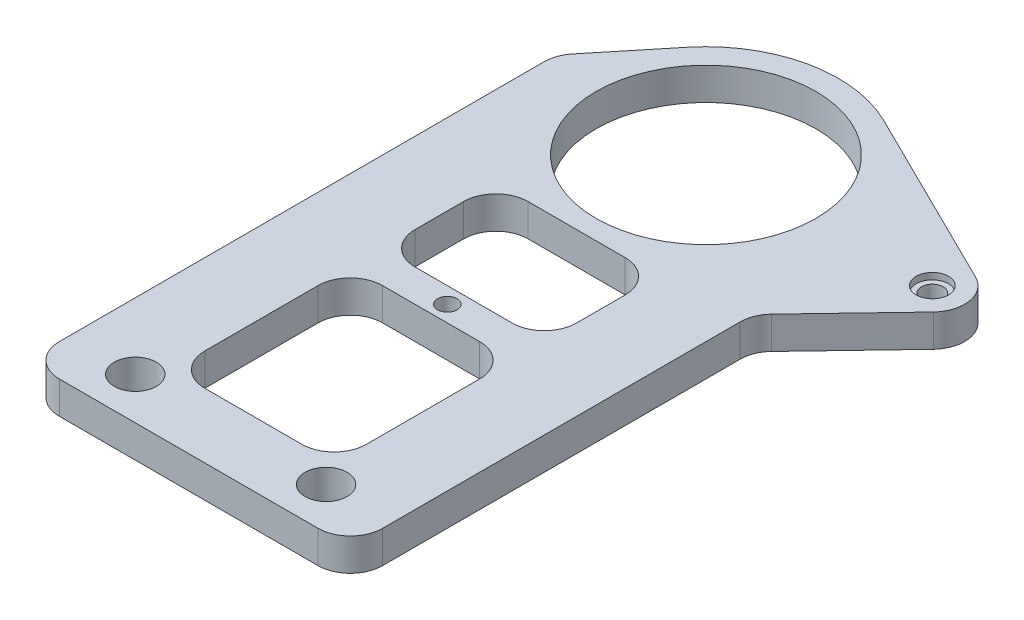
ISO-10303-21;
HEADER;
FILE_DESCRIPTION(('STEP AP214'),'2;1');
FILE_NAME('part.step','',(''),(''),'','','');
FILE_SCHEMA(('AUTOMOTIVE_DESIGN { 1 0 10303 214 1 1 1 1 }'));
ENDSEC;
DATA;
#1=APPLICATION_CONTEXT('core data for automotive mechanical design processes');
#2=APPLICATION_PROTOCOL_DEFINITION('international standard','automotive_design',2000,#1);
#3=PRODUCT_CONTEXT('',#1,'mechanical');
#4=PRODUCT('Part','Part','',(#3));
#5=PRODUCT_RELATED_PRODUCT_CATEGORY('part','',(#4));
#6=PRODUCT_DEFINITION_FORMATION('','',#4);
#7=PRODUCT_DEFINITION_CONTEXT('part definition',#1,'design');
#8=PRODUCT_DEFINITION('design','',#6,#7);
#9=PRODUCT_DEFINITION_SHAPE('','',#8);
#10=(LENGTH_UNIT() NAMED_UNIT(*) SI_UNIT(.MILLI.,.METRE.));
#11=(NAMED_UNIT(*) PLANE_ANGLE_UNIT() SI_UNIT($,.RADIAN.));
#12=(NAMED_UNIT(*) SI_UNIT($,.STERADIAN.) SOLID_ANGLE_UNIT());
#13=UNCERTAINTY_MEASURE_WITH_UNIT(LENGTH_MEASURE(1.E-05),#10,'distance_accuracy_value','');
#14=(GEOMETRIC_REPRESENTATION_CONTEXT(3) GLOBAL_UNCERTAINTY_ASSIGNED_CONTEXT((#13)) GLOBAL_UNIT_ASSIGNED_CONTEXT((#10,
#11,#12)) REPRESENTATION_CONTEXT('',''));
#15=CARTESIAN_POINT('',(0.,0.,0.));
#16=DIRECTION('',(0.,0.,1.));
#17=DIRECTION('',(1.,0.,0.));
#18=AXIS2_PLACEMENT_3D('',#15,#16,#17);
#19=CARTESIAN_POINT('',(70.,10.,0.));
#20=DIRECTION('',(0.,1.,0.));
#21=DIRECTION('',(0.,0.,1.));
#22=AXIS2_PLACEMENT_3D('',#19,#20,#21);
#23=PLANE('',#22);
#24=CARTESIAN_POINT('',(70.,10.,0.));
#25=DIRECTION('',(0.,1.,0.));
#26=DIRECTION('',(0.,0.,1.));
#27=AXIS2_PLACEMENT_3D('',#24,#25,#26);
#28=CIRCLE('',#27,5.);
#29=CARTESIAN_POINT('',(70.,10.,5.));
#30=VERTEX_POINT('',#29);
#31=EDGE_CURVE('E742',#30,#30,#28,.T.);
#32=ORIENTED_EDGE('',*,*,#31,.F.);
#33=EDGE_LOOP('',(#32));
#34=FACE_BOUND('',#33,.T.);
#35=CARTESIAN_POINT('',(29.4999999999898,10.,147.));
#36=DIRECTION('',(0.,1.,0.));
#37=DIRECTION('',(0.,0.,1.));
#38=AXIS2_PLACEMENT_3D('',#35,#36,#37);
#39=CIRCLE('',#38,6.50000000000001);
#40=CARTESIAN_POINT('',(29.4999999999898,10.,153.5));
#41=VERTEX_POINT('',#40);
#42=EDGE_CURVE('E758',#41,#41,#39,.T.);
#43=ORIENTED_EDGE('',*,*,#42,.F.);
#44=EDGE_LOOP('',(#43));
#45=FACE_BOUND('',#44,.T.);
#46=DIRECTION('',(0.,0.,1.));
#47=VECTOR('',#46,1.);
#48=CARTESIAN_POINT('',(25.,10.,50.));
#49=LINE('',#48,#47);
#50=CARTESIAN_POINT('',(25.,10.,50.));
#51=VERTEX_POINT('',#50);
#52=CARTESIAN_POINT('',(25.,10.,65.));
#53=VERTEX_POINT('',#52);
#54=EDGE_CURVE('E322',#51,#53,#49,.T.);
#55=ORIENTED_EDGE('',*,*,#54,.T.);
#56=CARTESIAN_POINT('',(15.,10.,65.));
#57=DIRECTION('',(0.,1.,0.));
#58=DIRECTION('',(0.,0.,1.));
#59=AXIS2_PLACEMENT_3D('',#56,#57,#58);
#60=CIRCLE('',#59,9.99999999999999);
#61=CARTESIAN_POINT('',(15.,10.,75.));
#62=VERTEX_POINT('',#61);
#63=EDGE_CURVE('E320',#62,#53,#60,.T.);
#64=ORIENTED_EDGE('',*,*,#63,.F.);
#65=DIRECTION('',(1.,0.,0.));
#66=VECTOR('',#65,1.);
#67=CARTESIAN_POINT('',(-15.,10.,75.));
#68=LINE('',#67,#66);
#69=CARTESIAN_POINT('',(-15.,10.,75.));
#70=VERTEX_POINT('',#69);
#71=EDGE_CURVE('E338',#70,#62,#68,.T.);
#72=ORIENTED_EDGE('',*,*,#71,.F.);
#73=CARTESIAN_POINT('',(-15.,10.,65.));
#74=DIRECTION('',(0.,-1.,0.));
#75=DIRECTION('',(0.,0.,-1.));
#76=AXIS2_PLACEMENT_3D('',#73,#74,#75);
#77=CIRCLE('',#76,9.99999999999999);
#78=CARTESIAN_POINT('',(-25.,10.,65.));
#79=VERTEX_POINT('',#78);
#80=EDGE_CURVE('E335',#70,#79,#77,.T.);
#81=ORIENTED_EDGE('',*,*,#80,.T.);
#82=DIRECTION('',(0.,0.,-1.));
#83=VECTOR('',#82,1.);
#84=CARTESIAN_POINT('',(-25.,10.,65.));
#85=LINE('',#84,#83);
#86=CARTESIAN_POINT('',(-25.,10.,50.));
#87=VERTEX_POINT('',#86);
#88=EDGE_CURVE('E332',#79,#87,#85,.T.);
#89=ORIENTED_EDGE('',*,*,#88,.T.);
#90=CARTESIAN_POINT('',(-15.,10.,50.));
#91=DIRECTION('',(0.,-1.,0.));
#92=DIRECTION('',(0.,0.,-1.));
#93=AXIS2_PLACEMENT_3D('',#90,#91,#92);
#94=CIRCLE('',#93,10.);
#95=CARTESIAN_POINT('',(-15.,10.,40.));
#96=VERTEX_POINT('',#95);
#97=EDGE_CURVE('E329',#87,#96,#94,.T.);
#98=ORIENTED_EDGE('',*,*,#97,.T.);
#99=DIRECTION('',(-1.,0.,0.));
#100=VECTOR('',#99,1.);
#101=CARTESIAN_POINT('',(15.,10.,40.));
#102=LINE('',#101,#100);
#103=CARTESIAN_POINT('',(15.,10.,40.));
#104=VERTEX_POINT('',#103);
#105=EDGE_CURVE('E327',#104,#96,#102,.T.);
#106=ORIENTED_EDGE('',*,*,#105,.F.);
#107=CARTESIAN_POINT('',(15.,10.,50.));
#108=DIRECTION('',(0.,1.,0.));
#109=DIRECTION('',(0.,0.,1.));
#110=AXIS2_PLACEMENT_3D('',#107,#108,#109);
#111=CIRCLE('',#110,10.);
#112=EDGE_CURVE('E325',#51,#104,#111,.T.);
#113=ORIENTED_EDGE('',*,*,#112,.F.);
#114=EDGE_LOOP('',(#55,#64,#72,#81,#89,#98,#106,#113));
#115=FACE_BOUND('',#114,.T.);
#116=CARTESIAN_POINT('',(70.,10.,0.));
#117=DIRECTION('',(0.,1.,0.));
#118=DIRECTION('',(0.,0.,1.));
#119=AXIS2_PLACEMENT_3D('',#116,#117,#118);
#120=CIRCLE('',#119,10.);
#121=CARTESIAN_POINT('',(77.2317249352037,10.,6.90667463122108));
#122=VERTEX_POINT('',#121);
#123=CARTESIAN_POINT('',(74.4285714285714,10.,-8.9659218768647));
#124=VERTEX_POINT('',#123);
#125=EDGE_CURVE('E388',#122,#124,#120,.T.);
#126=ORIENTED_EDGE('',*,*,#125,.T.);
#127=DIRECTION('',(-0.896592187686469,0.,-0.442857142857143));
#128=VECTOR('',#127,1.);
#129=CARTESIAN_POINT('',(74.4285714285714,10.,-8.9659218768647));
#130=LINE('',#129,#128);
#131=CARTESIAN_POINT('',(18.1571428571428,10.,-36.7602796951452));
#132=VERTEX_POINT('',#131);
#133=EDGE_CURVE('E391',#124,#132,#130,.T.);
#134=ORIENTED_EDGE('',*,*,#133,.T.);
#135=CARTESIAN_POINT('',(0.,10.,0.));
#136=DIRECTION('',(0.,1.,0.));
#137=DIRECTION('',(0.,0.,1.));
#138=AXIS2_PLACEMENT_3D('',#135,#136,#137);
#139=CIRCLE('',#138,41.);
#140=CARTESIAN_POINT('',(-31.775,10.,-25.9104105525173));
#141=VERTEX_POINT('',#140);
#142=EDGE_CURVE('E393',#132,#141,#139,.T.);
#143=ORIENTED_EDGE('',*,*,#142,.T.);
#144=DIRECTION('',(0.631961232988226,0.,-0.775));
#145=VECTOR('',#144,1.);
#146=CARTESIAN_POINT('',(-47.75,10.,-6.31961232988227));
#147=LINE('',#146,#145);
#148=CARTESIAN_POINT('',(-47.75,10.,-6.31961232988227));
#149=VERTEX_POINT('',#148);
#150=EDGE_CURVE('E395',#149,#141,#147,.T.);
#151=ORIENTED_EDGE('',*,*,#150,.F.);
#152=CARTESIAN_POINT('',(-40.,10.,0.));
#153=DIRECTION('',(0.,1.,0.));
#154=DIRECTION('',(0.,0.,1.));
#155=AXIS2_PLACEMENT_3D('',#152,#153,#154);
#156=CIRCLE('',#155,10.);
#157=CARTESIAN_POINT('',(-50.,10.,0.));
#158=VERTEX_POINT('',#157);
#159=EDGE_CURVE('E398',#149,#158,#156,.T.);
#160=ORIENTED_EDGE('',*,*,#159,.T.);
#161=DIRECTION('',(0.,0.,-1.));
#162=VECTOR('',#161,1.);
#163=CARTESIAN_POINT('',(-50.,10.,150.));
#164=LINE('',#163,#162);
#165=CARTESIAN_POINT('',(-50.,10.,150.));
#166=VERTEX_POINT('',#165);
#167=EDGE_CURVE('E400',#166,#158,#164,.T.);
#168=ORIENTED_EDGE('',*,*,#167,.F.);
#169=CARTESIAN_POINT('',(-40.,10.,150.));
#170=DIRECTION('',(0.,-1.,0.));
#171=DIRECTION('',(0.,0.,-1.));
#172=AXIS2_PLACEMENT_3D('',#169,#170,#171);
#173=CIRCLE('',#172,10.);
#174=CARTESIAN_POINT('',(-40.,10.,160.));
#175=VERTEX_POINT('',#174);
#176=EDGE_CURVE('E403',#175,#166,#173,.T.);
#177=ORIENTED_EDGE('',*,*,#176,.F.);
#178=DIRECTION('',(-1.,0.,0.));
#179=VECTOR('',#178,1.);
#180=CARTESIAN_POINT('',(40.,10.,160.));
#181=LINE('',#180,#179);
#182=CARTESIAN_POINT('',(40.,10.,160.));
#183=VERTEX_POINT('',#182);
#184=EDGE_CURVE('E406',#183,#175,#181,.T.);
#185=ORIENTED_EDGE('',*,*,#184,.F.);
#186=CARTESIAN_POINT('',(40.,10.,150.));
#187=DIRECTION('',(0.,1.,0.));
#188=DIRECTION('',(0.,0.,1.));
#189=AXIS2_PLACEMENT_3D('',#186,#187,#188);
#190=CIRCLE('',#189,10.);
#191=CARTESIAN_POINT('',(50.,10.,150.));
#192=VERTEX_POINT('',#191);
#193=EDGE_CURVE('E409',#183,#192,#190,.T.);
#194=ORIENTED_EDGE('',*,*,#193,.T.);
#195=DIRECTION('',(0.,0.,-1.));
#196=VECTOR('',#195,1.);
#197=CARTESIAN_POINT('',(50.,10.,150.));
#198=LINE('',#197,#196);
#199=CARTESIAN_POINT('',(50.,10.,39.4281277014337));
#200=VERTEX_POINT('',#199);
#201=EDGE_CURVE('E411',#192,#200,#198,.T.);
#202=ORIENTED_EDGE('',*,*,#201,.T.);
#203=CARTESIAN_POINT('',(60.,10.,39.4281277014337));
#204=DIRECTION('',(0.,-1.,0.));
#205=DIRECTION('',(0.,0.,-1.));
#206=AXIS2_PLACEMENT_3D('',#203,#204,#205);
#207=CIRCLE('',#206,10.);
#208=CARTESIAN_POINT('',(52.7682750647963,10.,32.5214530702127));
#209=VERTEX_POINT('',#208);
#210=EDGE_CURVE('E413',#200,#209,#207,.T.);
#211=ORIENTED_EDGE('',*,*,#210,.T.);
#212=DIRECTION('',(0.690667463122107,0.,-0.723172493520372));
#213=VECTOR('',#212,1.);
#214=CARTESIAN_POINT('',(52.7682750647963,10.,32.5214530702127));
#215=LINE('',#214,#213);
#216=EDGE_CURVE('E415',#209,#122,#215,.T.);
#217=ORIENTED_EDGE('',*,*,#216,.T.);
#218=EDGE_LOOP('',(#126,#134,#143,#151,#160,#168,#177,#185,#194,#202,#211,#217));
#219=FACE_BOUND('',#218,.T.);
#220=CARTESIAN_POINT('',(0.,10.,0.));
#221=DIRECTION('',(0.,1.,0.));
#222=DIRECTION('',(0.,0.,1.));
#223=AXIS2_PLACEMENT_3D('',#220,#221,#222);
#224=CIRCLE('',#223,34.);
#225=CARTESIAN_POINT('',(0.,10.,34.));
#226=VERTEX_POINT('',#225);
#227=EDGE_CURVE('E293',#226,#226,#224,.T.);
#228=ORIENTED_EDGE('',*,*,#227,.F.);
#229=EDGE_LOOP('',(#228));
#230=FACE_BOUND('',#229,.T.);
#231=DIRECTION('',(0.,0.,1.));
#232=VECTOR('',#231,1.);
#233=CARTESIAN_POINT('',(-25.,10.,95.));
#234=LINE('',#233,#232);
#235=CARTESIAN_POINT('',(-25.,10.,95.));
#236=VERTEX_POINT('',#235);
#237=CARTESIAN_POINT('',(-24.9999999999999,10.,130.));
#238=VERTEX_POINT('',#237);
#239=EDGE_CURVE('E263',#236,#238,#234,.T.);
#240=ORIENTED_EDGE('',*,*,#239,.F.);
#241=CARTESIAN_POINT('',(-15.,10.,95.));
#242=DIRECTION('',(0.,1.,0.));
#243=DIRECTION('',(0.,0.,1.));
#244=AXIS2_PLACEMENT_3D('',#241,#242,#243);
#245=CIRCLE('',#244,9.99999999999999);
#246=CARTESIAN_POINT('',(-15.,10.,85.));
#247=VERTEX_POINT('',#246);
#248=EDGE_CURVE('E232',#247,#236,#245,.T.);
#249=ORIENTED_EDGE('',*,*,#248,.F.);
#250=DIRECTION('',(1.,0.,0.));
#251=VECTOR('',#250,1.);
#252=CARTESIAN_POINT('',(-15.,10.,85.));
#253=LINE('',#252,#251);
#254=CARTESIAN_POINT('',(15.,10.,85.));
#255=VERTEX_POINT('',#254);
#256=EDGE_CURVE('E275',#247,#255,#253,.T.);
#257=ORIENTED_EDGE('',*,*,#256,.T.);
#258=CARTESIAN_POINT('',(15.,10.,95.));
#259=DIRECTION('',(0.,-1.,0.));
#260=DIRECTION('',(0.,0.,-1.));
#261=AXIS2_PLACEMENT_3D('',#258,#259,#260);
#262=CIRCLE('',#261,9.99999999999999);
#263=CARTESIAN_POINT('',(25.,10.,95.));
#264=VERTEX_POINT('',#263);
#265=EDGE_CURVE('E47',#255,#264,#262,.T.);
#266=ORIENTED_EDGE('',*,*,#265,.T.);
#267=DIRECTION('',(0.,0.,-1.));
#268=VECTOR('',#267,1.);
#269=CARTESIAN_POINT('',(24.9999999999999,10.,130.));
#270=LINE('',#269,#268);
#271=CARTESIAN_POINT('',(24.9999999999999,10.,130.));
#272=VERTEX_POINT('',#271);
#273=EDGE_CURVE('E272',#272,#264,#270,.T.);
#274=ORIENTED_EDGE('',*,*,#273,.F.);
#275=CARTESIAN_POINT('',(14.9999999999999,10.,130.));
#276=DIRECTION('',(0.,1.,0.));
#277=DIRECTION('',(0.,0.,1.));
#278=AXIS2_PLACEMENT_3D('',#275,#276,#277);
#279=CIRCLE('',#278,10.);
#280=CARTESIAN_POINT('',(14.9999999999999,10.,140.));
#281=VERTEX_POINT('',#280);
#282=EDGE_CURVE('E270',#281,#272,#279,.T.);
#283=ORIENTED_EDGE('',*,*,#282,.F.);
#284=DIRECTION('',(1.,0.,0.));
#285=VECTOR('',#284,1.);
#286=CARTESIAN_POINT('',(-14.9999999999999,10.,140.));
#287=LINE('',#286,#285);
#288=CARTESIAN_POINT('',(-14.9999999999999,10.,140.));
#289=VERTEX_POINT('',#288);
#290=EDGE_CURVE('E268',#289,#281,#287,.T.);
#291=ORIENTED_EDGE('',*,*,#290,.F.);
#292=CARTESIAN_POINT('',(-14.9999999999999,10.,130.));
#293=DIRECTION('',(0.,-1.,0.));
#294=DIRECTION('',(0.,0.,-1.));
#295=AXIS2_PLACEMENT_3D('',#292,#293,#294);
#296=CIRCLE('',#295,10.);
#297=EDGE_CURVE('E265',#289,#238,#296,.T.);
#298=ORIENTED_EDGE('',*,*,#297,.T.);
#299=EDGE_LOOP('',(#240,#249,#257,#266,#274,#283,#291,#298));
#300=FACE_BOUND('',#299,.T.);
#301=CARTESIAN_POINT('',(0.,10.,80.));
#302=DIRECTION('',(0.,1.,0.));
#303=DIRECTION('',(0.,0.,1.));
#304=AXIS2_PLACEMENT_3D('',#301,#302,#303);
#305=CIRCLE('',#304,3.);
#306=CARTESIAN_POINT('',(0.,10.,83.));
#307=VERTEX_POINT('',#306);
#308=EDGE_CURVE('E241',#307,#307,#305,.T.);
#309=ORIENTED_EDGE('',*,*,#308,.F.);
#310=EDGE_LOOP('',(#309));
#311=FACE_BOUND('',#310,.T.);
#312=CARTESIAN_POINT('',(-29.4999999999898,10.,147.));
#313=DIRECTION('',(0.,1.,0.));
#314=DIRECTION('',(0.,0.,1.));
#315=AXIS2_PLACEMENT_3D('',#312,#313,#314);
#316=CIRCLE('',#315,6.5);
#317=CARTESIAN_POINT('',(-29.4999999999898,10.,153.5));
#318=VERTEX_POINT('',#317);
#319=EDGE_CURVE('E752',#318,#318,#316,.T.);
#320=ORIENTED_EDGE('',*,*,#319,.F.);
#321=EDGE_LOOP('',(#320));
#322=FACE_BOUND('',#321,.T.);
#323=ADVANCED_FACE('F31',(#34,#45,#115,#219,#230,#300,#311,#322),#23,.T.);
#324=CARTESIAN_POINT('',(70.,0.,0.));
#325=DIRECTION('',(0.,1.,0.));
#326=DIRECTION('',(0.,0.,1.));
#327=AXIS2_PLACEMENT_3D('',#324,#325,#326);
#328=PLANE('',#327);
#329=CARTESIAN_POINT('',(70.,0.,0.));
#330=DIRECTION('',(0.,1.,0.));
#331=DIRECTION('',(0.,0.,1.));
#332=AXIS2_PLACEMENT_3D('',#329,#330,#331);
#333=CIRCLE('',#332,3.375);
#334=CARTESIAN_POINT('',(70.,0.,3.375));
#335=VERTEX_POINT('',#334);
#336=EDGE_CURVE('E740',#335,#335,#333,.T.);
#337=ORIENTED_EDGE('',*,*,#336,.T.);
#338=EDGE_LOOP('',(#337));
#339=FACE_BOUND('',#338,.T.);
#340=CARTESIAN_POINT('',(29.4999999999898,0.,147.));
#341=DIRECTION('',(0.,1.,0.));
#342=DIRECTION('',(0.,0.,1.));
#343=AXIS2_PLACEMENT_3D('',#340,#341,#342);
#344=CIRCLE('',#343,6.50000000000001);
#345=CARTESIAN_POINT('',(29.4999999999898,0.,153.5));
#346=VERTEX_POINT('',#345);
#347=EDGE_CURVE('E755',#346,#346,#344,.T.);
#348=ORIENTED_EDGE('',*,*,#347,.T.);
#349=EDGE_LOOP('',(#348));
#350=FACE_BOUND('',#349,.T.);
#351=CARTESIAN_POINT('',(15.,0.,65.));
#352=DIRECTION('',(0.,1.,0.));
#353=DIRECTION('',(0.,0.,1.));
#354=AXIS2_PLACEMENT_3D('',#351,#352,#353);
#355=CIRCLE('',#354,9.99999999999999);
#356=CARTESIAN_POINT('',(15.,0.,75.));
#357=VERTEX_POINT('',#356);
#358=CARTESIAN_POINT('',(25.,0.,65.));
#359=VERTEX_POINT('',#358);
#360=EDGE_CURVE('E296',#357,#359,#355,.T.);
#361=ORIENTED_EDGE('',*,*,#360,.T.);
#362=DIRECTION('',(0.,0.,1.));
#363=VECTOR('',#362,1.);
#364=CARTESIAN_POINT('',(25.,0.,50.));
#365=LINE('',#364,#363);
#366=CARTESIAN_POINT('',(25.,0.,50.));
#367=VERTEX_POINT('',#366);
#368=EDGE_CURVE('E299',#367,#359,#365,.T.);
#369=ORIENTED_EDGE('',*,*,#368,.F.);
#370=CARTESIAN_POINT('',(15.,0.,50.));
#371=DIRECTION('',(0.,1.,0.));
#372=DIRECTION('',(0.,0.,1.));
#373=AXIS2_PLACEMENT_3D('',#370,#371,#372);
#374=CIRCLE('',#373,10.);
#375=CARTESIAN_POINT('',(15.,0.,40.));
#376=VERTEX_POINT('',#375);
#377=EDGE_CURVE('E302',#367,#376,#374,.T.);
#378=ORIENTED_EDGE('',*,*,#377,.T.);
#379=DIRECTION('',(-1.,0.,0.));
#380=VECTOR('',#379,1.);
#381=CARTESIAN_POINT('',(15.,0.,40.));
#382=LINE('',#381,#380);
#383=CARTESIAN_POINT('',(-15.,0.,40.));
#384=VERTEX_POINT('',#383);
#385=EDGE_CURVE('E305',#376,#384,#382,.T.);
#386=ORIENTED_EDGE('',*,*,#385,.T.);
#387=CARTESIAN_POINT('',(-15.,0.,50.));
#388=DIRECTION('',(0.,-1.,0.));
#389=DIRECTION('',(0.,0.,-1.));
#390=AXIS2_PLACEMENT_3D('',#387,#388,#389);
#391=CIRCLE('',#390,10.);
#392=CARTESIAN_POINT('',(-25.,0.,50.));
#393=VERTEX_POINT('',#392);
#394=EDGE_CURVE('E308',#393,#384,#391,.T.);
#395=ORIENTED_EDGE('',*,*,#394,.F.);
#396=DIRECTION('',(0.,0.,-1.));
#397=VECTOR('',#396,1.);
#398=CARTESIAN_POINT('',(-25.,0.,65.));
#399=LINE('',#398,#397);
#400=CARTESIAN_POINT('',(-25.,0.,65.));
#401=VERTEX_POINT('',#400);
#402=EDGE_CURVE('E311',#401,#393,#399,.T.);
#403=ORIENTED_EDGE('',*,*,#402,.F.);
#404=CARTESIAN_POINT('',(-15.,0.,65.));
#405=DIRECTION('',(0.,-1.,0.));
#406=DIRECTION('',(0.,0.,-1.));
#407=AXIS2_PLACEMENT_3D('',#404,#405,#406);
#408=CIRCLE('',#407,9.99999999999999);
#409=CARTESIAN_POINT('',(-15.,0.,75.));
#410=VERTEX_POINT('',#409);
#411=EDGE_CURVE('E314',#410,#401,#408,.T.);
#412=ORIENTED_EDGE('',*,*,#411,.F.);
#413=DIRECTION('',(1.,0.,0.));
#414=VECTOR('',#413,1.);
#415=CARTESIAN_POINT('',(-15.,0.,75.));
#416=LINE('',#415,#414);
#417=EDGE_CURVE('E317',#410,#357,#416,.T.);
#418=ORIENTED_EDGE('',*,*,#417,.T.);
#419=EDGE_LOOP('',(#361,#369,#378,#386,#395,#403,#412,#418));
#420=FACE_BOUND('',#419,.T.);
#421=CARTESIAN_POINT('',(70.,0.,0.));
#422=DIRECTION('',(0.,1.,0.));
#423=DIRECTION('',(0.,0.,1.));
#424=AXIS2_PLACEMENT_3D('',#421,#422,#423);
#425=CIRCLE('',#424,10.);
#426=CARTESIAN_POINT('',(77.2317249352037,0.,6.90667463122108));
#427=VERTEX_POINT('',#426);
#428=CARTESIAN_POINT('',(74.4285714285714,0.,-8.9659218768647));
#429=VERTEX_POINT('',#428);
#430=EDGE_CURVE('E357',#427,#429,#425,.T.);
#431=ORIENTED_EDGE('',*,*,#430,.F.);
#432=DIRECTION('',(0.690667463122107,0.,-0.723172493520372));
#433=VECTOR('',#432,1.);
#434=CARTESIAN_POINT('',(52.7682750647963,0.,32.5214530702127));
#435=LINE('',#434,#433);
#436=CARTESIAN_POINT('',(52.7682750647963,0.,32.5214530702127));
#437=VERTEX_POINT('',#436);
#438=EDGE_CURVE('E386',#437,#427,#435,.T.);
#439=ORIENTED_EDGE('',*,*,#438,.F.);
#440=CARTESIAN_POINT('',(60.,0.,39.4281277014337));
#441=DIRECTION('',(0.,-1.,0.));
#442=DIRECTION('',(0.,0.,-1.));
#443=AXIS2_PLACEMENT_3D('',#440,#441,#442);
#444=CIRCLE('',#443,10.);
#445=CARTESIAN_POINT('',(50.,0.,39.4281277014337));
#446=VERTEX_POINT('',#445);
#447=EDGE_CURVE('E384',#446,#437,#444,.T.);
#448=ORIENTED_EDGE('',*,*,#447,.F.);
#449=DIRECTION('',(0.,0.,-1.));
#450=VECTOR('',#449,1.);
#451=CARTESIAN_POINT('',(50.,0.,150.));
#452=LINE('',#451,#450);
#453=CARTESIAN_POINT('',(50.,0.,150.));
#454=VERTEX_POINT('',#453);
#455=EDGE_CURVE('E382',#454,#446,#452,.T.);
#456=ORIENTED_EDGE('',*,*,#455,.F.);
#457=CARTESIAN_POINT('',(40.,0.,150.));
#458=DIRECTION('',(0.,1.,0.));
#459=DIRECTION('',(0.,0.,1.));
#460=AXIS2_PLACEMENT_3D('',#457,#458,#459);
#461=CIRCLE('',#460,10.);
#462=CARTESIAN_POINT('',(40.,0.,160.));
#463=VERTEX_POINT('',#462);
#464=EDGE_CURVE('E380',#463,#454,#461,.T.);
#465=ORIENTED_EDGE('',*,*,#464,.F.);
#466=DIRECTION('',(-1.,0.,0.));
#467=VECTOR('',#466,1.);
#468=CARTESIAN_POINT('',(40.,0.,160.));
#469=LINE('',#468,#467);
#470=CARTESIAN_POINT('',(-40.,0.,160.));
#471=VERTEX_POINT('',#470);
#472=EDGE_CURVE('E377',#463,#471,#469,.T.);
#473=ORIENTED_EDGE('',*,*,#472,.T.);
#474=CARTESIAN_POINT('',(-40.,0.,150.));
#475=DIRECTION('',(0.,-1.,0.));
#476=DIRECTION('',(0.,0.,-1.));
#477=AXIS2_PLACEMENT_3D('',#474,#475,#476);
#478=CIRCLE('',#477,10.);
#479=CARTESIAN_POINT('',(-50.,0.,150.));
#480=VERTEX_POINT('',#479);
#481=EDGE_CURVE('E374',#471,#480,#478,.T.);
#482=ORIENTED_EDGE('',*,*,#481,.T.);
#483=DIRECTION('',(0.,0.,-1.));
#484=VECTOR('',#483,1.);
#485=CARTESIAN_POINT('',(-50.,0.,150.));
#486=LINE('',#485,#484);
#487=CARTESIAN_POINT('',(-50.,0.,0.));
#488=VERTEX_POINT('',#487);
#489=EDGE_CURVE('E371',#480,#488,#486,.T.);
#490=ORIENTED_EDGE('',*,*,#489,.T.);
#491=CARTESIAN_POINT('',(-40.,0.,0.));
#492=DIRECTION('',(0.,1.,0.));
#493=DIRECTION('',(0.,0.,1.));
#494=AXIS2_PLACEMENT_3D('',#491,#492,#493);
#495=CIRCLE('',#494,10.);
#496=CARTESIAN_POINT('',(-47.75,0.,-6.31961232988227));
#497=VERTEX_POINT('',#496);
#498=EDGE_CURVE('E368',#497,#488,#495,.T.);
#499=ORIENTED_EDGE('',*,*,#498,.F.);
#500=DIRECTION('',(0.631961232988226,0.,-0.775));
#501=VECTOR('',#500,1.);
#502=CARTESIAN_POINT('',(-47.75,0.,-6.31961232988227));
#503=LINE('',#502,#501);
#504=CARTESIAN_POINT('',(-31.775,0.,-25.9104105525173));
#505=VERTEX_POINT('',#504);
#506=EDGE_CURVE('E365',#497,#505,#503,.T.);
#507=ORIENTED_EDGE('',*,*,#506,.T.);
#508=CARTESIAN_POINT('',(0.,0.,0.));
#509=DIRECTION('',(0.,1.,0.));
#510=DIRECTION('',(0.,0.,1.));
#511=AXIS2_PLACEMENT_3D('',#508,#509,#510);
#512=CIRCLE('',#511,41.);
#513=CARTESIAN_POINT('',(18.1571428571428,0.,-36.7602796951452));
#514=VERTEX_POINT('',#513);
#515=EDGE_CURVE('E362',#514,#505,#512,.T.);
#516=ORIENTED_EDGE('',*,*,#515,.F.);
#517=DIRECTION('',(-0.896592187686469,0.,-0.442857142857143));
#518=VECTOR('',#517,1.);
#519=CARTESIAN_POINT('',(74.4285714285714,0.,-8.9659218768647));
#520=LINE('',#519,#518);
#521=EDGE_CURVE('E360',#429,#514,#520,.T.);
#522=ORIENTED_EDGE('',*,*,#521,.F.);
#523=EDGE_LOOP('',(#431,#439,#448,#456,#465,#473,#482,#490,#499,#507,#516,#522));
#524=FACE_BOUND('',#523,.T.);
#525=CARTESIAN_POINT('',(0.,0.,0.));
#526=DIRECTION('',(0.,1.,0.));
#527=DIRECTION('',(0.,0.,1.));
#528=AXIS2_PLACEMENT_3D('',#525,#526,#527);
#529=CIRCLE('',#528,34.);
#530=CARTESIAN_POINT('',(0.,0.,34.));
#531=VERTEX_POINT('',#530);
#532=EDGE_CURVE('E233',#531,#531,#529,.T.);
#533=ORIENTED_EDGE('',*,*,#532,.T.);
#534=EDGE_LOOP('',(#533));
#535=FACE_BOUND('',#534,.T.);
#536=CARTESIAN_POINT('',(-15.,0.,95.));
#537=DIRECTION('',(0.,1.,0.));
#538=DIRECTION('',(0.,0.,1.));
#539=AXIS2_PLACEMENT_3D('',#536,#537,#538);
#540=CIRCLE('',#539,9.99999999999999);
#541=CARTESIAN_POINT('',(-15.,0.,85.));
#542=VERTEX_POINT('',#541);
#543=CARTESIAN_POINT('',(-25.,0.,95.));
#544=VERTEX_POINT('',#543);
#545=EDGE_CURVE('E55',#542,#544,#540,.T.);
#546=ORIENTED_EDGE('',*,*,#545,.T.);
#547=DIRECTION('',(0.,0.,1.));
#548=VECTOR('',#547,1.);
#549=CARTESIAN_POINT('',(-25.,0.,95.));
#550=LINE('',#549,#548);
#551=CARTESIAN_POINT('',(-24.9999999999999,0.,130.));
#552=VERTEX_POINT('',#551);
#553=EDGE_CURVE('E219',#544,#552,#550,.T.);
#554=ORIENTED_EDGE('',*,*,#553,.T.);
#555=CARTESIAN_POINT('',(-14.9999999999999,0.,130.));
#556=DIRECTION('',(0.,-1.,0.));
#557=DIRECTION('',(0.,0.,-1.));
#558=AXIS2_PLACEMENT_3D('',#555,#556,#557);
#559=CIRCLE('',#558,10.);
#560=CARTESIAN_POINT('',(-14.9999999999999,0.,140.));
#561=VERTEX_POINT('',#560);
#562=EDGE_CURVE('E228',#561,#552,#559,.T.);
#563=ORIENTED_EDGE('',*,*,#562,.F.);
#564=DIRECTION('',(1.,0.,0.));
#565=VECTOR('',#564,1.);
#566=CARTESIAN_POINT('',(-14.9999999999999,0.,140.));
#567=LINE('',#566,#565);
#568=CARTESIAN_POINT('',(14.9999999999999,0.,140.));
#569=VERTEX_POINT('',#568);
#570=EDGE_CURVE('E249',#561,#569,#567,.T.);
#571=ORIENTED_EDGE('',*,*,#570,.T.);
#572=CARTESIAN_POINT('',(14.9999999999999,0.,130.));
#573=DIRECTION('',(0.,1.,0.));
#574=DIRECTION('',(0.,0.,1.));
#575=AXIS2_PLACEMENT_3D('',#572,#573,#574);
#576=CIRCLE('',#575,10.);
#577=CARTESIAN_POINT('',(24.9999999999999,0.,130.));
#578=VERTEX_POINT('',#577);
#579=EDGE_CURVE('E252',#569,#578,#576,.T.);
#580=ORIENTED_EDGE('',*,*,#579,.T.);
#581=DIRECTION('',(0.,0.,-1.));
#582=VECTOR('',#581,1.);
#583=CARTESIAN_POINT('',(24.9999999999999,0.,130.));
#584=LINE('',#583,#582);
#585=CARTESIAN_POINT('',(25.,0.,95.));
#586=VERTEX_POINT('',#585);
#587=EDGE_CURVE('E255',#578,#586,#584,.T.);
#588=ORIENTED_EDGE('',*,*,#587,.T.);
#589=CARTESIAN_POINT('',(15.,0.,95.));
#590=DIRECTION('',(0.,-1.,0.));
#591=DIRECTION('',(0.,0.,-1.));
#592=AXIS2_PLACEMENT_3D('',#589,#590,#591);
#593=CIRCLE('',#592,9.99999999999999);
#594=CARTESIAN_POINT('',(15.,0.,85.));
#595=VERTEX_POINT('',#594);
#596=EDGE_CURVE('E258',#595,#586,#593,.T.);
#597=ORIENTED_EDGE('',*,*,#596,.F.);
#598=DIRECTION('',(1.,0.,0.));
#599=VECTOR('',#598,1.);
#600=CARTESIAN_POINT('',(-15.,0.,85.));
#601=LINE('',#600,#599);
#602=EDGE_CURVE('E240',#542,#595,#601,.T.);
#603=ORIENTED_EDGE('',*,*,#602,.F.);
#604=EDGE_LOOP('',(#546,#554,#563,#571,#580,#588,#597,#603));
#605=FACE_BOUND('',#604,.T.);
#606=CARTESIAN_POINT('',(0.,0.,80.));
#607=DIRECTION('',(0.,1.,0.));
#608=DIRECTION('',(0.,0.,1.));
#609=AXIS2_PLACEMENT_3D('',#606,#607,#608);
#610=CIRCLE('',#609,3.);
#611=CARTESIAN_POINT('',(0.,0.,83.));
#612=VERTEX_POINT('',#611);
#613=EDGE_CURVE('E244',#612,#612,#610,.T.);
#614=ORIENTED_EDGE('',*,*,#613,.T.);
#615=EDGE_LOOP('',(#614));
#616=FACE_BOUND('',#615,.T.);
#617=CARTESIAN_POINT('',(-29.4999999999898,0.,147.));
#618=DIRECTION('',(0.,1.,0.));
#619=DIRECTION('',(0.,0.,1.));
#620=AXIS2_PLACEMENT_3D('',#617,#618,#619);
#621=CIRCLE('',#620,6.5);
#622=CARTESIAN_POINT('',(-29.4999999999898,0.,153.5));
#623=VERTEX_POINT('',#622);
#624=EDGE_CURVE('E749',#623,#623,#621,.T.);
#625=ORIENTED_EDGE('',*,*,#624,.T.);
#626=EDGE_LOOP('',(#625));
#627=FACE_BOUND('',#626,.T.);
#628=ADVANCED_FACE('F236',(#339,#350,#420,#524,#535,#605,#616,#627),#328,.F.);
#629=CARTESIAN_POINT('',(70.,10.,0.));
#630=DIRECTION('',(0.,-1.,0.));
#631=DIRECTION('',(0.,0.,-1.));
#632=AXIS2_PLACEMENT_3D('',#629,#630,#631);
#633=CYLINDRICAL_SURFACE('',#632,10.);
#634=ORIENTED_EDGE('',*,*,#430,.T.);
#635=DIRECTION('',(0.,-1.,0.));
#636=VECTOR('',#635,1.);
#637=CARTESIAN_POINT('',(74.4285714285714,10.,-8.9659218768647));
#638=LINE('',#637,#636);
#639=EDGE_CURVE('E11',#124,#429,#638,.T.);
#640=ORIENTED_EDGE('',*,*,#639,.F.);
#641=ORIENTED_EDGE('',*,*,#125,.F.);
#642=DIRECTION('',(0.,-1.,0.));
#643=VECTOR('',#642,1.);
#644=CARTESIAN_POINT('',(77.2317249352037,10.,6.90667463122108));
#645=LINE('',#644,#643);
#646=EDGE_CURVE('E417',#122,#427,#645,.T.);
#647=ORIENTED_EDGE('',*,*,#646,.T.);
#648=EDGE_LOOP('',(#634,#640,#641,#647));
#649=FACE_BOUND('',#648,.T.);
#650=ADVANCED_FACE('F33',(#649),#633,.T.);
#651=CARTESIAN_POINT('',(74.4285714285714,10.,-8.9659218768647));
#652=DIRECTION('',(-0.442857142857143,0.,0.896592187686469));
#653=DIRECTION('',(0.896592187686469,0.,0.442857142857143));
#654=AXIS2_PLACEMENT_3D('',#651,#652,#653);
#655=PLANE('',#654);
#656=ORIENTED_EDGE('',*,*,#521,.T.);
#657=DIRECTION('',(0.,-1.,0.));
#658=VECTOR('',#657,1.);
#659=CARTESIAN_POINT('',(18.1571428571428,10.,-36.7602796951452));
#660=LINE('',#659,#658);
#661=EDGE_CURVE('E40',#132,#514,#660,.T.);
#662=ORIENTED_EDGE('',*,*,#661,.F.);
#663=ORIENTED_EDGE('',*,*,#133,.F.);
#664=ORIENTED_EDGE('',*,*,#639,.T.);
#665=EDGE_LOOP('',(#656,#662,#663,#664));
#666=FACE_BOUND('',#665,.T.);
#667=ADVANCED_FACE('F464',(#666),#655,.F.);
#668=CARTESIAN_POINT('',(0.,10.,0.));
#669=DIRECTION('',(0.,-1.,0.));
#670=DIRECTION('',(0.,0.,-1.));
#671=AXIS2_PLACEMENT_3D('',#668,#669,#670);
#672=CYLINDRICAL_SURFACE('',#671,41.);
#673=ORIENTED_EDGE('',*,*,#515,.T.);
#674=DIRECTION('',(0.,-1.,0.));
#675=VECTOR('',#674,1.);
#676=CARTESIAN_POINT('',(-31.775,10.,-25.9104105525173));
#677=LINE('',#676,#675);
#678=EDGE_CURVE('E439',#141,#505,#677,.T.);
#679=ORIENTED_EDGE('',*,*,#678,.F.);
#680=ORIENTED_EDGE('',*,*,#142,.F.);
#681=ORIENTED_EDGE('',*,*,#661,.T.);
#682=EDGE_LOOP('',(#673,#679,#680,#681));
#683=FACE_BOUND('',#682,.T.);
#684=ADVANCED_FACE('F446',(#683),#672,.T.);
#685=CARTESIAN_POINT('',(-47.75,10.,-6.31961232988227));
#686=DIRECTION('',(-0.775,0.,-0.631961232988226));
#687=DIRECTION('',(-0.631961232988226,0.,0.775000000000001));
#688=AXIS2_PLACEMENT_3D('',#685,#686,#687);
#689=PLANE('',#688);
#690=ORIENTED_EDGE('',*,*,#506,.F.);
#691=DIRECTION('',(0.,-1.,0.));
#692=VECTOR('',#691,1.);
#693=CARTESIAN_POINT('',(-47.75,10.,-6.31961232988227));
#694=LINE('',#693,#692);
#695=EDGE_CURVE('E437',#149,#497,#694,.T.);
#696=ORIENTED_EDGE('',*,*,#695,.F.);
#697=ORIENTED_EDGE('',*,*,#150,.T.);
#698=ORIENTED_EDGE('',*,*,#678,.T.);
#699=EDGE_LOOP('',(#690,#696,#697,#698));
#700=FACE_BOUND('',#699,.T.);
#701=ADVANCED_FACE('F455',(#700),#689,.T.);
#702=CARTESIAN_POINT('',(-40.,10.,0.));
#703=DIRECTION('',(0.,-1.,0.));
#704=DIRECTION('',(0.,0.,-1.));
#705=AXIS2_PLACEMENT_3D('',#702,#703,#704);
#706=CYLINDRICAL_SURFACE('',#705,10.);
#707=ORIENTED_EDGE('',*,*,#498,.T.);
#708=DIRECTION('',(0.,-1.,0.));
#709=VECTOR('',#708,1.);
#710=CARTESIAN_POINT('',(-50.,10.,0.));
#711=LINE('',#710,#709);
#712=EDGE_CURVE('E435',#158,#488,#711,.T.);
#713=ORIENTED_EDGE('',*,*,#712,.F.);
#714=ORIENTED_EDGE('',*,*,#159,.F.);
#715=ORIENTED_EDGE('',*,*,#695,.T.);
#716=EDGE_LOOP('',(#707,#713,#714,#715));
#717=FACE_BOUND('',#716,.T.);
#718=ADVANCED_FACE('F497',(#717),#706,.T.);
#719=CARTESIAN_POINT('',(-50.,10.,150.));
#720=DIRECTION('',(-1.,0.,0.));
#721=DIRECTION('',(0.,0.,1.));
#722=AXIS2_PLACEMENT_3D('',#719,#720,#721);
#723=PLANE('',#722);
#724=ORIENTED_EDGE('',*,*,#489,.F.);
#725=DIRECTION('',(0.,-1.,0.));
#726=VECTOR('',#725,1.);
#727=CARTESIAN_POINT('',(-50.,10.,150.));
#728=LINE('',#727,#726);
#729=EDGE_CURVE('E433',#166,#480,#728,.T.);
#730=ORIENTED_EDGE('',*,*,#729,.F.);
#731=ORIENTED_EDGE('',*,*,#167,.T.);
#732=ORIENTED_EDGE('',*,*,#712,.T.);
#733=EDGE_LOOP('',(#724,#730,#731,#732));
#734=FACE_BOUND('',#733,.T.);
#735=ADVANCED_FACE('F495',(#734),#723,.T.);
#736=CARTESIAN_POINT('',(-40.,10.,150.));
#737=DIRECTION('',(0.,-1.,0.));
#738=DIRECTION('',(0.,0.,-1.));
#739=AXIS2_PLACEMENT_3D('',#736,#737,#738);
#740=CYLINDRICAL_SURFACE('',#739,10.);
#741=ORIENTED_EDGE('',*,*,#481,.F.);
#742=DIRECTION('',(0.,-1.,0.));
#743=VECTOR('',#742,1.);
#744=CARTESIAN_POINT('',(-40.,10.,160.));
#745=LINE('',#744,#743);
#746=EDGE_CURVE('E431',#175,#471,#745,.T.);
#747=ORIENTED_EDGE('',*,*,#746,.F.);
#748=ORIENTED_EDGE('',*,*,#176,.T.);
#749=ORIENTED_EDGE('',*,*,#729,.T.);
#750=EDGE_LOOP('',(#741,#747,#748,#749));
#751=FACE_BOUND('',#750,.T.);
#752=ADVANCED_FACE('F492',(#751),#740,.T.);
#753=CARTESIAN_POINT('',(40.,10.,160.));
#754=DIRECTION('',(0.,0.,1.));
#755=DIRECTION('',(1.,0.,0.));
#756=AXIS2_PLACEMENT_3D('',#753,#754,#755);
#757=PLANE('',#756);
#758=ORIENTED_EDGE('',*,*,#472,.F.);
#759=DIRECTION('',(0.,-1.,0.));
#760=VECTOR('',#759,1.);
#761=CARTESIAN_POINT('',(40.,10.,160.));
#762=LINE('',#761,#760);
#763=EDGE_CURVE('E429',#183,#463,#762,.T.);
#764=ORIENTED_EDGE('',*,*,#763,.F.);
#765=ORIENTED_EDGE('',*,*,#184,.T.);
#766=ORIENTED_EDGE('',*,*,#746,.T.);
#767=EDGE_LOOP('',(#758,#764,#765,#766));
#768=FACE_BOUND('',#767,.T.);
#769=ADVANCED_FACE('F486',(#768),#757,.T.);
#770=CARTESIAN_POINT('',(40.,10.,150.));
#771=DIRECTION('',(0.,-1.,0.));
#772=DIRECTION('',(0.,0.,-1.));
#773=AXIS2_PLACEMENT_3D('',#770,#771,#772);
#774=CYLINDRICAL_SURFACE('',#773,10.);
#775=ORIENTED_EDGE('',*,*,#464,.T.);
#776=DIRECTION('',(0.,-1.,0.));
#777=VECTOR('',#776,1.);
#778=CARTESIAN_POINT('',(50.,10.,150.));
#779=LINE('',#778,#777);
#780=EDGE_CURVE('E426',#192,#454,#779,.T.);
#781=ORIENTED_EDGE('',*,*,#780,.F.);
#782=ORIENTED_EDGE('',*,*,#193,.F.);
#783=ORIENTED_EDGE('',*,*,#763,.T.);
#784=EDGE_LOOP('',(#775,#781,#782,#783));
#785=FACE_BOUND('',#784,.T.);
#786=ADVANCED_FACE('F527',(#785),#774,.T.);
#787=CARTESIAN_POINT('',(50.,10.,150.));
#788=DIRECTION('',(-1.,0.,0.));
#789=DIRECTION('',(0.,0.,1.));
#790=AXIS2_PLACEMENT_3D('',#787,#788,#789);
#791=PLANE('',#790);
#792=ORIENTED_EDGE('',*,*,#455,.T.);
#793=DIRECTION('',(0.,-1.,0.));
#794=VECTOR('',#793,1.);
#795=CARTESIAN_POINT('',(50.,10.,39.4281277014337));
#796=LINE('',#795,#794);
#797=EDGE_CURVE('E423',#200,#446,#796,.T.);
#798=ORIENTED_EDGE('',*,*,#797,.F.);
#799=ORIENTED_EDGE('',*,*,#201,.F.);
#800=ORIENTED_EDGE('',*,*,#780,.T.);
#801=EDGE_LOOP('',(#792,#798,#799,#800));
#802=FACE_BOUND('',#801,.T.);
#803=ADVANCED_FACE('F480',(#802),#791,.F.);
#804=CARTESIAN_POINT('',(60.,10.,39.4281277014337));
#805=DIRECTION('',(0.,-1.,0.));
#806=DIRECTION('',(0.,0.,-1.));
#807=AXIS2_PLACEMENT_3D('',#804,#805,#806);
#808=CYLINDRICAL_SURFACE('',#807,10.);
#809=ORIENTED_EDGE('',*,*,#447,.T.);
#810=DIRECTION('',(0.,-1.,0.));
#811=VECTOR('',#810,1.);
#812=CARTESIAN_POINT('',(52.7682750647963,10.,32.5214530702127));
#813=LINE('',#812,#811);
#814=EDGE_CURVE('E420',#209,#437,#813,.T.);
#815=ORIENTED_EDGE('',*,*,#814,.F.);
#816=ORIENTED_EDGE('',*,*,#210,.F.);
#817=ORIENTED_EDGE('',*,*,#797,.T.);
#818=EDGE_LOOP('',(#809,#815,#816,#817));
#819=FACE_BOUND('',#818,.T.);
#820=ADVANCED_FACE('F476',(#819),#808,.F.);
#821=CARTESIAN_POINT('',(52.7682750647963,10.,32.5214530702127));
#822=DIRECTION('',(-0.723172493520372,0.,-0.690667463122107));
#823=DIRECTION('',(-0.690667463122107,0.,0.723172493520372));
#824=AXIS2_PLACEMENT_3D('',#821,#822,#823);
#825=PLANE('',#824);
#826=ORIENTED_EDGE('',*,*,#438,.T.);
#827=ORIENTED_EDGE('',*,*,#646,.F.);
#828=ORIENTED_EDGE('',*,*,#216,.F.);
#829=ORIENTED_EDGE('',*,*,#814,.T.);
#830=EDGE_LOOP('',(#826,#827,#828,#829));
#831=FACE_BOUND('',#830,.T.);
#832=ADVANCED_FACE('F471',(#831),#825,.F.);
#833=CARTESIAN_POINT('',(15.,10.,65.));
#834=DIRECTION('',(0.,-1.,0.));
#835=DIRECTION('',(0.,0.,-1.));
#836=AXIS2_PLACEMENT_3D('',#833,#834,#835);
#837=CYLINDRICAL_SURFACE('',#836,9.99999999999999);
#838=ORIENTED_EDGE('',*,*,#360,.F.);
#839=DIRECTION('',(0.,-1.,0.));
#840=VECTOR('',#839,1.);
#841=CARTESIAN_POINT('',(15.,10.,75.));
#842=LINE('',#841,#840);
#843=EDGE_CURVE('E340',#62,#357,#842,.T.);
#844=ORIENTED_EDGE('',*,*,#843,.F.);
#845=ORIENTED_EDGE('',*,*,#63,.T.);
#846=DIRECTION('',(0.,-1.,0.));
#847=VECTOR('',#846,1.);
#848=CARTESIAN_POINT('',(25.,10.,65.));
#849=LINE('',#848,#847);
#850=EDGE_CURVE('E355',#53,#359,#849,.T.);
#851=ORIENTED_EDGE('',*,*,#850,.T.);
#852=EDGE_LOOP('',(#838,#844,#845,#851));
#853=FACE_BOUND('',#852,.T.);
#854=ADVANCED_FACE('F522',(#853),#837,.F.);
#855=CARTESIAN_POINT('',(25.,10.,50.));
#856=DIRECTION('',(1.,0.,0.));
#857=DIRECTION('',(0.,0.,-1.));
#858=AXIS2_PLACEMENT_3D('',#855,#856,#857);
#859=PLANE('',#858);
#860=ORIENTED_EDGE('',*,*,#368,.T.);
#861=ORIENTED_EDGE('',*,*,#850,.F.);
#862=ORIENTED_EDGE('',*,*,#54,.F.);
#863=DIRECTION('',(0.,-1.,0.));
#864=VECTOR('',#863,1.);
#865=CARTESIAN_POINT('',(25.,10.,50.));
#866=LINE('',#865,#864);
#867=EDGE_CURVE('E353',#51,#367,#866,.T.);
#868=ORIENTED_EDGE('',*,*,#867,.T.);
#869=EDGE_LOOP('',(#860,#861,#862,#868));
#870=FACE_BOUND('',#869,.T.);
#871=ADVANCED_FACE('F563',(#870),#859,.F.);
#872=CARTESIAN_POINT('',(15.,10.,50.));
#873=DIRECTION('',(0.,-1.,0.));
#874=DIRECTION('',(0.,0.,-1.));
#875=AXIS2_PLACEMENT_3D('',#872,#873,#874);
#876=CYLINDRICAL_SURFACE('',#875,10.);
#877=ORIENTED_EDGE('',*,*,#377,.F.);
#878=ORIENTED_EDGE('',*,*,#867,.F.);
#879=ORIENTED_EDGE('',*,*,#112,.T.);
#880=DIRECTION('',(0.,-1.,0.));
#881=VECTOR('',#880,1.);
#882=CARTESIAN_POINT('',(15.,10.,40.));
#883=LINE('',#882,#881);
#884=EDGE_CURVE('E351',#104,#376,#883,.T.);
#885=ORIENTED_EDGE('',*,*,#884,.T.);
#886=EDGE_LOOP('',(#877,#878,#879,#885));
#887=FACE_BOUND('',#886,.T.);
#888=ADVANCED_FACE('F570',(#887),#876,.F.);
#889=CARTESIAN_POINT('',(15.,10.,40.));
#890=DIRECTION('',(0.,0.,1.));
#891=DIRECTION('',(1.,0.,0.));
#892=AXIS2_PLACEMENT_3D('',#889,#890,#891);
#893=PLANE('',#892);
#894=ORIENTED_EDGE('',*,*,#385,.F.);
#895=ORIENTED_EDGE('',*,*,#884,.F.);
#896=ORIENTED_EDGE('',*,*,#105,.T.);
#897=DIRECTION('',(0.,-1.,0.));
#898=VECTOR('',#897,1.);
#899=CARTESIAN_POINT('',(-15.,10.,40.));
#900=LINE('',#899,#898);
#901=EDGE_CURVE('E349',#96,#384,#900,.T.);
#902=ORIENTED_EDGE('',*,*,#901,.T.);
#903=EDGE_LOOP('',(#894,#895,#896,#902));
#904=FACE_BOUND('',#903,.T.);
#905=ADVANCED_FACE('F578',(#904),#893,.T.);
#906=CARTESIAN_POINT('',(-15.,10.,50.));
#907=DIRECTION('',(0.,-1.,0.));
#908=DIRECTION('',(0.,0.,-1.));
#909=AXIS2_PLACEMENT_3D('',#906,#907,#908);
#910=CYLINDRICAL_SURFACE('',#909,10.);
#911=ORIENTED_EDGE('',*,*,#394,.T.);
#912=ORIENTED_EDGE('',*,*,#901,.F.);
#913=ORIENTED_EDGE('',*,*,#97,.F.);
#914=DIRECTION('',(0.,-1.,0.));
#915=VECTOR('',#914,1.);
#916=CARTESIAN_POINT('',(-25.,10.,50.));
#917=LINE('',#916,#915);
#918=EDGE_CURVE('E347',#87,#393,#917,.T.);
#919=ORIENTED_EDGE('',*,*,#918,.T.);
#920=EDGE_LOOP('',(#911,#912,#913,#919));
#921=FACE_BOUND('',#920,.T.);
#922=ADVANCED_FACE('F586',(#921),#910,.F.);
#923=CARTESIAN_POINT('',(-25.,10.,65.));
#924=DIRECTION('',(-1.,0.,0.));
#925=DIRECTION('',(0.,0.,1.));
#926=AXIS2_PLACEMENT_3D('',#923,#924,#925);
#927=PLANE('',#926);
#928=ORIENTED_EDGE('',*,*,#402,.T.);
#929=ORIENTED_EDGE('',*,*,#918,.F.);
#930=ORIENTED_EDGE('',*,*,#88,.F.);
#931=DIRECTION('',(0.,-1.,0.));
#932=VECTOR('',#931,1.);
#933=CARTESIAN_POINT('',(-25.,10.,65.));
#934=LINE('',#933,#932);
#935=EDGE_CURVE('E345',#79,#401,#934,.T.);
#936=ORIENTED_EDGE('',*,*,#935,.T.);
#937=EDGE_LOOP('',(#928,#929,#930,#936));
#938=FACE_BOUND('',#937,.T.);
#939=ADVANCED_FACE('F594',(#938),#927,.F.);
#940=CARTESIAN_POINT('',(-15.,10.,65.));
#941=DIRECTION('',(0.,-1.,0.));
#942=DIRECTION('',(0.,0.,-1.));
#943=AXIS2_PLACEMENT_3D('',#940,#941,#942);
#944=CYLINDRICAL_SURFACE('',#943,9.99999999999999);
#945=ORIENTED_EDGE('',*,*,#411,.T.);
#946=ORIENTED_EDGE('',*,*,#935,.F.);
#947=ORIENTED_EDGE('',*,*,#80,.F.);
#948=DIRECTION('',(0.,-1.,0.));
#949=VECTOR('',#948,1.);
#950=CARTESIAN_POINT('',(-15.,10.,75.));
#951=LINE('',#950,#949);
#952=EDGE_CURVE('E343',#70,#410,#951,.T.);
#953=ORIENTED_EDGE('',*,*,#952,.T.);
#954=EDGE_LOOP('',(#945,#946,#947,#953));
#955=FACE_BOUND('',#954,.T.);
#956=ADVANCED_FACE('F602',(#955),#944,.F.);
#957=CARTESIAN_POINT('',(-15.,10.,75.));
#958=DIRECTION('',(0.,0.,-1.));
#959=DIRECTION('',(-1.,0.,0.));
#960=AXIS2_PLACEMENT_3D('',#957,#958,#959);
#961=PLANE('',#960);
#962=ORIENTED_EDGE('',*,*,#417,.F.);
#963=ORIENTED_EDGE('',*,*,#952,.F.);
#964=ORIENTED_EDGE('',*,*,#71,.T.);
#965=ORIENTED_EDGE('',*,*,#843,.T.);
#966=EDGE_LOOP('',(#962,#963,#964,#965));
#967=FACE_BOUND('',#966,.T.);
#968=ADVANCED_FACE('F610',(#967),#961,.T.);
#969=CARTESIAN_POINT('',(0.,10.,0.));
#970=DIRECTION('',(0.,-1.,0.));
#971=DIRECTION('',(0.,0.,-1.));
#972=AXIS2_PLACEMENT_3D('',#969,#970,#971);
#973=CYLINDRICAL_SURFACE('',#972,34.);
#974=ORIENTED_EDGE('',*,*,#227,.T.);
#975=EDGE_LOOP('',(#974));
#976=FACE_BOUND('',#975,.T.);
#977=ORIENTED_EDGE('',*,*,#532,.F.);
#978=EDGE_LOOP('',(#977));
#979=FACE_BOUND('',#978,.T.);
#980=ADVANCED_FACE('F618',(#976,#979),#973,.F.);
#981=CARTESIAN_POINT('',(-15.,10.,95.));
#982=DIRECTION('',(0.,-1.,0.));
#983=DIRECTION('',(0.,0.,-1.));
#984=AXIS2_PLACEMENT_3D('',#981,#982,#983);
#985=CYLINDRICAL_SURFACE('',#984,9.99999999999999);
#986=ORIENTED_EDGE('',*,*,#545,.F.);
#987=DIRECTION('',(0.,-1.,0.));
#988=VECTOR('',#987,1.);
#989=CARTESIAN_POINT('',(-15.,10.,85.));
#990=LINE('',#989,#988);
#991=EDGE_CURVE('E278',#247,#542,#990,.T.);
#992=ORIENTED_EDGE('',*,*,#991,.F.);
#993=ORIENTED_EDGE('',*,*,#248,.T.);
#994=DIRECTION('',(0.,-1.,0.));
#995=VECTOR('',#994,1.);
#996=CARTESIAN_POINT('',(-25.,10.,95.));
#997=LINE('',#996,#995);
#998=EDGE_CURVE('E221',#236,#544,#997,.T.);
#999=ORIENTED_EDGE('',*,*,#998,.T.);
#1000=EDGE_LOOP('',(#986,#992,#993,#999));
#1001=FACE_BOUND('',#1000,.T.);
#1002=ADVANCED_FACE('F230',(#1001),#985,.F.);
#1003=CARTESIAN_POINT('',(-25.,10.,95.));
#1004=DIRECTION('',(1.,0.,0.));
#1005=DIRECTION('',(0.,0.,-1.));
#1006=AXIS2_PLACEMENT_3D('',#1003,#1004,#1005);
#1007=PLANE('',#1006);
#1008=ORIENTED_EDGE('',*,*,#553,.F.);
#1009=ORIENTED_EDGE('',*,*,#998,.F.);
#1010=ORIENTED_EDGE('',*,*,#239,.T.);
#1011=DIRECTION('',(0.,-1.,0.));
#1012=VECTOR('',#1011,1.);
#1013=CARTESIAN_POINT('',(-24.9999999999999,10.,130.));
#1014=LINE('',#1013,#1012);
#1015=EDGE_CURVE('E224',#238,#552,#1014,.T.);
#1016=ORIENTED_EDGE('',*,*,#1015,.T.);
#1017=EDGE_LOOP('',(#1008,#1009,#1010,#1016));
#1018=FACE_BOUND('',#1017,.T.);
#1019=ADVANCED_FACE('F220',(#1018),#1007,.T.);
#1020=CARTESIAN_POINT('',(-14.9999999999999,10.,130.));
#1021=DIRECTION('',(0.,-1.,0.));
#1022=DIRECTION('',(0.,0.,-1.));
#1023=AXIS2_PLACEMENT_3D('',#1020,#1021,#1022);
#1024=CYLINDRICAL_SURFACE('',#1023,10.);
#1025=ORIENTED_EDGE('',*,*,#562,.T.);
#1026=ORIENTED_EDGE('',*,*,#1015,.F.);
#1027=ORIENTED_EDGE('',*,*,#297,.F.);
#1028=DIRECTION('',(0.,-1.,0.));
#1029=VECTOR('',#1028,1.);
#1030=CARTESIAN_POINT('',(-14.9999999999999,10.,140.));
#1031=LINE('',#1030,#1029);
#1032=EDGE_CURVE('E288',#289,#561,#1031,.T.);
#1033=ORIENTED_EDGE('',*,*,#1032,.T.);
#1034=EDGE_LOOP('',(#1025,#1026,#1027,#1033));
#1035=FACE_BOUND('',#1034,.T.);
#1036=ADVANCED_FACE('F639',(#1035),#1024,.F.);
#1037=CARTESIAN_POINT('',(-14.9999999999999,10.,140.));
#1038=DIRECTION('',(0.,0.,-1.));
#1039=DIRECTION('',(-1.,0.,0.));
#1040=AXIS2_PLACEMENT_3D('',#1037,#1038,#1039);
#1041=PLANE('',#1040);
#1042=ORIENTED_EDGE('',*,*,#570,.F.);
#1043=ORIENTED_EDGE('',*,*,#1032,.F.);
#1044=ORIENTED_EDGE('',*,*,#290,.T.);
#1045=DIRECTION('',(0.,-1.,0.));
#1046=VECTOR('',#1045,1.);
#1047=CARTESIAN_POINT('',(14.9999999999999,10.,140.));
#1048=LINE('',#1047,#1046);
#1049=EDGE_CURVE('E286',#281,#569,#1048,.T.);
#1050=ORIENTED_EDGE('',*,*,#1049,.T.);
#1051=EDGE_LOOP('',(#1042,#1043,#1044,#1050));
#1052=FACE_BOUND('',#1051,.T.);
#1053=ADVANCED_FACE('F646',(#1052),#1041,.T.);
#1054=CARTESIAN_POINT('',(14.9999999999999,10.,130.));
#1055=DIRECTION('',(0.,-1.,0.));
#1056=DIRECTION('',(0.,0.,-1.));
#1057=AXIS2_PLACEMENT_3D('',#1054,#1055,#1056);
#1058=CYLINDRICAL_SURFACE('',#1057,10.);
#1059=ORIENTED_EDGE('',*,*,#579,.F.);
#1060=ORIENTED_EDGE('',*,*,#1049,.F.);
#1061=ORIENTED_EDGE('',*,*,#282,.T.);
#1062=DIRECTION('',(0.,-1.,0.));
#1063=VECTOR('',#1062,1.);
#1064=CARTESIAN_POINT('',(24.9999999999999,10.,130.));
#1065=LINE('',#1064,#1063);
#1066=EDGE_CURVE('E284',#272,#578,#1065,.T.);
#1067=ORIENTED_EDGE('',*,*,#1066,.T.);
#1068=EDGE_LOOP('',(#1059,#1060,#1061,#1067));
#1069=FACE_BOUND('',#1068,.T.);
#1070=ADVANCED_FACE('F654',(#1069),#1058,.F.);
#1071=CARTESIAN_POINT('',(24.9999999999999,10.,130.));
#1072=DIRECTION('',(-1.,0.,0.));
#1073=DIRECTION('',(0.,0.,1.));
#1074=AXIS2_PLACEMENT_3D('',#1071,#1072,#1073);
#1075=PLANE('',#1074);
#1076=ORIENTED_EDGE('',*,*,#587,.F.);
#1077=ORIENTED_EDGE('',*,*,#1066,.F.);
#1078=ORIENTED_EDGE('',*,*,#273,.T.);
#1079=DIRECTION('',(0.,-1.,0.));
#1080=VECTOR('',#1079,1.);
#1081=CARTESIAN_POINT('',(25.,10.,95.));
#1082=LINE('',#1081,#1080);
#1083=EDGE_CURVE('E282',#264,#586,#1082,.T.);
#1084=ORIENTED_EDGE('',*,*,#1083,.T.);
#1085=EDGE_LOOP('',(#1076,#1077,#1078,#1084));
#1086=FACE_BOUND('',#1085,.T.);
#1087=ADVANCED_FACE('F662',(#1086),#1075,.T.);
#1088=CARTESIAN_POINT('',(15.,10.,95.));
#1089=DIRECTION('',(0.,-1.,0.));
#1090=DIRECTION('',(0.,0.,-1.));
#1091=AXIS2_PLACEMENT_3D('',#1088,#1089,#1090);
#1092=CYLINDRICAL_SURFACE('',#1091,9.99999999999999);
#1093=ORIENTED_EDGE('',*,*,#596,.T.);
#1094=ORIENTED_EDGE('',*,*,#1083,.F.);
#1095=ORIENTED_EDGE('',*,*,#265,.F.);
#1096=DIRECTION('',(0.,-1.,0.));
#1097=VECTOR('',#1096,1.);
#1098=CARTESIAN_POINT('',(15.,10.,85.));
#1099=LINE('',#1098,#1097);
#1100=EDGE_CURVE('E280',#255,#595,#1099,.T.);
#1101=ORIENTED_EDGE('',*,*,#1100,.T.);
#1102=EDGE_LOOP('',(#1093,#1094,#1095,#1101));
#1103=FACE_BOUND('',#1102,.T.);
#1104=ADVANCED_FACE('F670',(#1103),#1092,.F.);
#1105=CARTESIAN_POINT('',(-15.,10.,85.));
#1106=DIRECTION('',(0.,0.,-1.));
#1107=DIRECTION('',(-1.,0.,0.));
#1108=AXIS2_PLACEMENT_3D('',#1105,#1106,#1107);
#1109=PLANE('',#1108);
#1110=ORIENTED_EDGE('',*,*,#602,.T.);
#1111=ORIENTED_EDGE('',*,*,#1100,.F.);
#1112=ORIENTED_EDGE('',*,*,#256,.F.);
#1113=ORIENTED_EDGE('',*,*,#991,.T.);
#1114=EDGE_LOOP('',(#1110,#1111,#1112,#1113));
#1115=FACE_BOUND('',#1114,.T.);
#1116=ADVANCED_FACE('F678',(#1115),#1109,.F.);
#1117=CARTESIAN_POINT('',(0.,10.,80.));
#1118=DIRECTION('',(0.,-1.,0.));
#1119=DIRECTION('',(0.,0.,-1.));
#1120=AXIS2_PLACEMENT_3D('',#1117,#1118,#1119);
#1121=CYLINDRICAL_SURFACE('',#1120,3.);
#1122=ORIENTED_EDGE('',*,*,#308,.T.);
#1123=EDGE_LOOP('',(#1122));
#1124=FACE_BOUND('',#1123,.T.);
#1125=ORIENTED_EDGE('',*,*,#613,.F.);
#1126=EDGE_LOOP('',(#1125));
#1127=FACE_BOUND('',#1126,.T.);
#1128=ADVANCED_FACE('F685',(#1124,#1127),#1121,.F.);
#1129=CARTESIAN_POINT('',(29.4999999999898,10.,147.));
#1130=DIRECTION('',(0.,-1.,0.));
#1131=DIRECTION('',(0.,0.,-1.));
#1132=AXIS2_PLACEMENT_3D('',#1129,#1130,#1131);
#1133=CYLINDRICAL_SURFACE('',#1132,6.50000000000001);
#1134=ORIENTED_EDGE('',*,*,#42,.T.);
#1135=EDGE_LOOP('',(#1134));
#1136=FACE_BOUND('',#1135,.T.);
#1137=ORIENTED_EDGE('',*,*,#347,.F.);
#1138=EDGE_LOOP('',(#1137));
#1139=FACE_BOUND('',#1138,.T.);
#1140=ADVANCED_FACE('F694',(#1136,#1139),#1133,.F.);
#1141=CARTESIAN_POINT('',(-29.4999999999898,10.,147.));
#1142=DIRECTION('',(0.,-1.,0.));
#1143=DIRECTION('',(0.,0.,-1.));
#1144=AXIS2_PLACEMENT_3D('',#1141,#1142,#1143);
#1145=CYLINDRICAL_SURFACE('',#1144,6.5);
#1146=ORIENTED_EDGE('',*,*,#319,.T.);
#1147=EDGE_LOOP('',(#1146));
#1148=FACE_BOUND('',#1147,.T.);
#1149=ORIENTED_EDGE('',*,*,#624,.F.);
#1150=EDGE_LOOP('',(#1149));
#1151=FACE_BOUND('',#1150,.T.);
#1152=ADVANCED_FACE('F701',(#1148,#1151),#1145,.F.);
#1153=CARTESIAN_POINT('',(70.,8.,0.));
#1154=DIRECTION('',(0.,1.,0.));
#1155=DIRECTION('',(0.,0.,1.));
#1156=AXIS2_PLACEMENT_3D('',#1153,#1154,#1155);
#1157=CYLINDRICAL_SURFACE('',#1156,5.);
#1158=CARTESIAN_POINT('',(70.,8.,0.));
#1159=DIRECTION('',(0.,1.,0.));
#1160=DIRECTION('',(0.,0.,1.));
#1161=AXIS2_PLACEMENT_3D('',#1158,#1159,#1160);
#1162=CIRCLE('',#1161,5.);
#1163=CARTESIAN_POINT('',(70.,8.,5.));
#1164=VERTEX_POINT('',#1163);
#1165=EDGE_CURVE('E746',#1164,#1164,#1162,.T.);
#1166=ORIENTED_EDGE('',*,*,#1165,.F.);
#1167=EDGE_LOOP('',(#1166));
#1168=FACE_BOUND('',#1167,.T.);
#1169=ORIENTED_EDGE('',*,*,#31,.T.);
#1170=EDGE_LOOP('',(#1169));
#1171=FACE_BOUND('',#1170,.T.);
#1172=ADVANCED_FACE('F708',(#1168,#1171),#1157,.F.);
#1173=CARTESIAN_POINT('',(70.,8.,0.));
#1174=DIRECTION('',(0.,1.,0.));
#1175=DIRECTION('',(0.,0.,1.));
#1176=AXIS2_PLACEMENT_3D('',#1173,#1174,#1175);
#1177=PLANE('',#1176);
#1178=CARTESIAN_POINT('',(70.,8.,0.));
#1179=DIRECTION('',(0.,1.,0.));
#1180=DIRECTION('',(0.,0.,1.));
#1181=AXIS2_PLACEMENT_3D('',#1178,#1179,#1180);
#1182=CIRCLE('',#1181,3.375);
#1183=CARTESIAN_POINT('',(70.,8.,3.375));
#1184=VERTEX_POINT('',#1183);
#1185=EDGE_CURVE('E35',#1184,#1184,#1182,.T.);
#1186=ORIENTED_EDGE('',*,*,#1185,.F.);
#1187=EDGE_LOOP('',(#1186));
#1188=FACE_BOUND('',#1187,.T.);
#1189=ORIENTED_EDGE('',*,*,#1165,.T.);
#1190=EDGE_LOOP('',(#1189));
#1191=FACE_BOUND('',#1190,.T.);
#1192=ADVANCED_FACE('F717',(#1188,#1191),#1177,.T.);
#1193=CARTESIAN_POINT('',(70.,0.,0.));
#1194=DIRECTION('',(0.,1.,0.));
#1195=DIRECTION('',(0.,0.,1.));
#1196=AXIS2_PLACEMENT_3D('',#1193,#1194,#1195);
#1197=CYLINDRICAL_SURFACE('',#1196,3.375);
#1198=ORIENTED_EDGE('',*,*,#1185,.T.);
#1199=EDGE_LOOP('',(#1198));
#1200=FACE_BOUND('',#1199,.T.);
#1201=ORIENTED_EDGE('',*,*,#336,.F.);
#1202=EDGE_LOOP('',(#1201));
#1203=FACE_BOUND('',#1202,.T.);
#1204=ADVANCED_FACE('F725',(#1200,#1203),#1197,.F.);
#1205=CLOSED_SHELL('',(#323,#628,#650,#667,#684,#701,#718,#735,#752,#769,#786,#803,#820,#832,
#854,#871,#888,#905,#922,#939,#956,#968,#980,#1002,#1019,#1036,#1053,#1070,#1087,#1104,#1116,
#1128,#1140,#1152,#1172,#1192,#1204));
#1206=MANIFOLD_SOLID_BREP('B2',#1205);
#1207=ADVANCED_BREP_SHAPE_REPRESENTATION('',(#18,#1206),#14);
#1208=SHAPE_DEFINITION_REPRESENTATION(#9,#1207);
ENDSEC;
END-ISO-10303-21;
